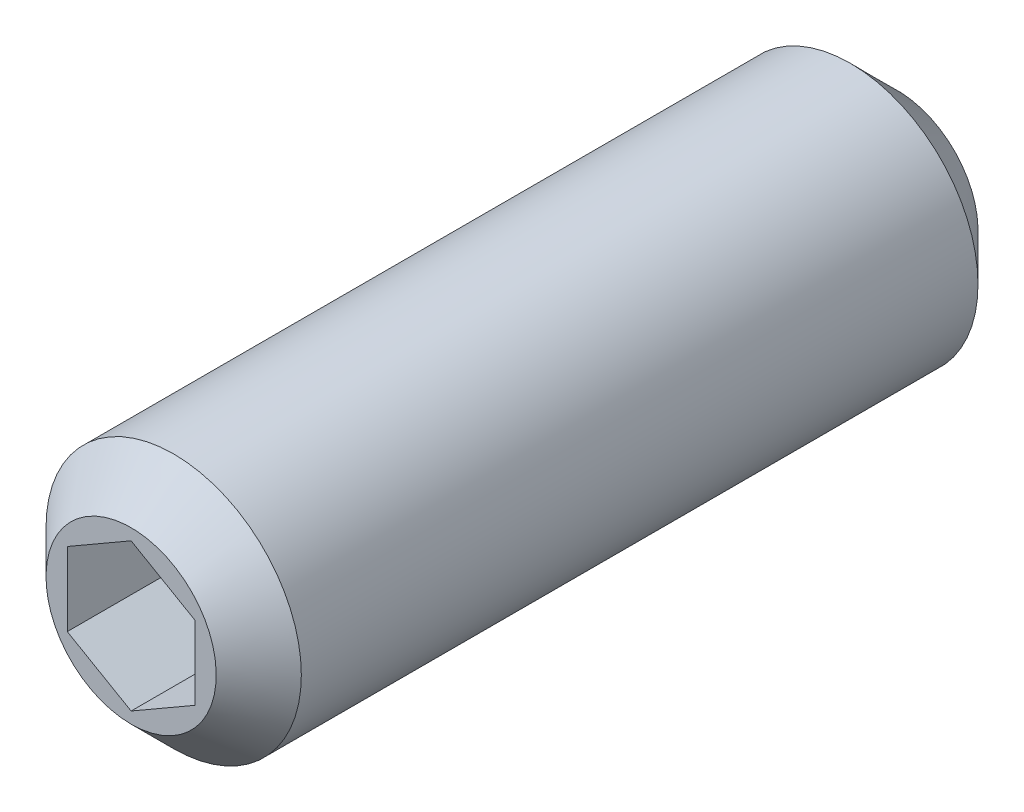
ISO-10303-21;
HEADER;
FILE_DESCRIPTION(('STEP AP214'),'2;1');
FILE_NAME('part.step','',(''),(''),'','','');
FILE_SCHEMA(('AUTOMOTIVE_DESIGN { 1 0 10303 214 1 1 1 1 }'));
ENDSEC;
DATA;
#1=APPLICATION_CONTEXT('core data for automotive mechanical design processes');
#2=APPLICATION_PROTOCOL_DEFINITION('international standard','automotive_design',2000,#1);
#3=PRODUCT_CONTEXT('',#1,'mechanical');
#4=PRODUCT('Part','Part','',(#3));
#5=PRODUCT_RELATED_PRODUCT_CATEGORY('part','',(#4));
#6=PRODUCT_DEFINITION_FORMATION('','',#4);
#7=PRODUCT_DEFINITION_CONTEXT('part definition',#1,'design');
#8=PRODUCT_DEFINITION('design','',#6,#7);
#9=PRODUCT_DEFINITION_SHAPE('','',#8);
#10=(LENGTH_UNIT() NAMED_UNIT(*) SI_UNIT(.MILLI.,.METRE.));
#11=(NAMED_UNIT(*) PLANE_ANGLE_UNIT() SI_UNIT($,.RADIAN.));
#12=(NAMED_UNIT(*) SI_UNIT($,.STERADIAN.) SOLID_ANGLE_UNIT());
#13=UNCERTAINTY_MEASURE_WITH_UNIT(LENGTH_MEASURE(1.E-05),#10,'distance_accuracy_value','');
#14=(GEOMETRIC_REPRESENTATION_CONTEXT(3) GLOBAL_UNCERTAINTY_ASSIGNED_CONTEXT((#13)) GLOBAL_UNIT_ASSIGNED_CONTEXT((#10,
#11,#12)) REPRESENTATION_CONTEXT('',''));
#15=CARTESIAN_POINT('',(0.,0.,0.));
#16=DIRECTION('',(0.,0.,1.));
#17=DIRECTION('',(1.,0.,0.));
#18=AXIS2_PLACEMENT_3D('',#15,#16,#17);
#19=CARTESIAN_POINT('',(0.,0.,9.5));
#20=DIRECTION('',(0.,0.,-1.));
#21=DIRECTION('',(0.,-1.,0.));
#22=AXIS2_PLACEMENT_3D('',#19,#20,#21);
#23=PLANE('',#22);
#24=DIRECTION('',(-0.866025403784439,-0.5,0.));
#25=VECTOR('',#24,1.);
#26=CARTESIAN_POINT('',(0.,0.866025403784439,9.5));
#27=LINE('',#26,#25);
#28=CARTESIAN_POINT('',(0.,0.866025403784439,9.5));
#29=VERTEX_POINT('',#28);
#30=CARTESIAN_POINT('',(-0.75,0.43301270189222,9.5));
#31=VERTEX_POINT('',#30);
#32=EDGE_CURVE('E173',#29,#31,#27,.T.);
#33=ORIENTED_EDGE('',*,*,#32,.F.);
#34=DIRECTION('',(-0.866025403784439,0.5,0.));
#35=VECTOR('',#34,1.);
#36=CARTESIAN_POINT('',(0.75,0.43301270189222,9.5));
#37=LINE('',#36,#35);
#38=CARTESIAN_POINT('',(0.75,0.43301270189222,9.5));
#39=VERTEX_POINT('',#38);
#40=EDGE_CURVE('E188',#39,#29,#37,.T.);
#41=ORIENTED_EDGE('',*,*,#40,.F.);
#42=DIRECTION('',(0.,1.,0.));
#43=VECTOR('',#42,1.);
#44=CARTESIAN_POINT('',(0.75,-0.433012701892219,9.5));
#45=LINE('',#44,#43);
#46=CARTESIAN_POINT('',(0.75,-0.433012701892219,9.5));
#47=VERTEX_POINT('',#46);
#48=EDGE_CURVE('E83',#47,#39,#45,.T.);
#49=ORIENTED_EDGE('',*,*,#48,.F.);
#50=DIRECTION('',(0.866025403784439,0.5,0.));
#51=VECTOR('',#50,1.);
#52=CARTESIAN_POINT('',(0.,-0.866025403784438,9.5));
#53=LINE('',#52,#51);
#54=CARTESIAN_POINT('',(0.,-0.866025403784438,9.5));
#55=VERTEX_POINT('',#54);
#56=EDGE_CURVE('E194',#55,#47,#53,.T.);
#57=ORIENTED_EDGE('',*,*,#56,.F.);
#58=DIRECTION('',(0.866025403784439,-0.5,0.));
#59=VECTOR('',#58,1.);
#60=CARTESIAN_POINT('',(-0.75,-0.433012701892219,9.5));
#61=LINE('',#60,#59);
#62=CARTESIAN_POINT('',(-0.75,-0.433012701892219,9.5));
#63=VERTEX_POINT('',#62);
#64=EDGE_CURVE('E192',#63,#55,#61,.T.);
#65=ORIENTED_EDGE('',*,*,#64,.F.);
#66=DIRECTION('',(0.,-1.,0.));
#67=VECTOR('',#66,1.);
#68=CARTESIAN_POINT('',(-0.75,0.43301270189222,9.5));
#69=LINE('',#68,#67);
#70=EDGE_CURVE('E178',#31,#63,#69,.T.);
#71=ORIENTED_EDGE('',*,*,#70,.F.);
#72=EDGE_LOOP('',(#33,#41,#49,#57,#65,#71));
#73=FACE_BOUND('',#72,.T.);
#74=CARTESIAN_POINT('',(0.,0.,9.5));
#75=DIRECTION('',(0.,0.,-1.));
#76=DIRECTION('',(0.,-1.,0.));
#77=AXIS2_PLACEMENT_3D('',#74,#75,#76);
#78=CIRCLE('',#77,1.);
#79=CARTESIAN_POINT('',(0.,-1.,9.5));
#80=VERTEX_POINT('',#79);
#81=EDGE_CURVE('E9',#80,#80,#78,.F.);
#82=ORIENTED_EDGE('',*,*,#81,.T.);
#83=EDGE_LOOP('',(#82));
#84=FACE_BOUND('',#83,.T.);
#85=ADVANCED_FACE('F14',(#73,#84),#23,.F.);
#86=CARTESIAN_POINT('',(0.,0.,0.5));
#87=DIRECTION('',(0.,0.,1.));
#88=DIRECTION('',(0.,1.,0.));
#89=AXIS2_PLACEMENT_3D('',#86,#87,#88);
#90=CYLINDRICAL_SURFACE('',#89,1.5);
#91=CARTESIAN_POINT('',(0.,0.,9.));
#92=DIRECTION('',(0.,0.,-1.));
#93=DIRECTION('',(0.,-1.,0.));
#94=AXIS2_PLACEMENT_3D('',#91,#92,#93);
#95=CIRCLE('',#94,1.5);
#96=CARTESIAN_POINT('',(0.,-1.5,9.));
#97=VERTEX_POINT('',#96);
#98=EDGE_CURVE('E22',#97,#97,#95,.T.);
#99=ORIENTED_EDGE('',*,*,#98,.T.);
#100=EDGE_LOOP('',(#99));
#101=FACE_BOUND('',#100,.T.);
#102=CARTESIAN_POINT('',(0.,0.,1.05));
#103=DIRECTION('',(0.,0.,-1.));
#104=DIRECTION('',(-1.,0.,0.));
#105=AXIS2_PLACEMENT_3D('',#102,#103,#104);
#106=CIRCLE('',#105,1.5);
#107=CARTESIAN_POINT('',(-1.5,0.,1.05));
#108=VERTEX_POINT('',#107);
#109=EDGE_CURVE('E73',#108,#108,#106,.T.);
#110=ORIENTED_EDGE('',*,*,#109,.F.);
#111=EDGE_LOOP('',(#110));
#112=FACE_BOUND('',#111,.T.);
#113=ADVANCED_FACE('F16',(#101,#112),#90,.T.);
#114=CARTESIAN_POINT('',(0.,0.,9.));
#115=DIRECTION('',(0.,0.,-1.));
#116=DIRECTION('',(0.,-1.,0.));
#117=AXIS2_PLACEMENT_3D('',#114,#115,#116);
#118=CONICAL_SURFACE('',#117,1.5,0.78539816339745);
#119=ORIENTED_EDGE('',*,*,#81,.F.);
#120=EDGE_LOOP('',(#119));
#121=FACE_BOUND('',#120,.T.);
#122=ORIENTED_EDGE('',*,*,#98,.F.);
#123=EDGE_LOOP('',(#122));
#124=FACE_BOUND('',#123,.T.);
#125=ADVANCED_FACE('F108',(#121,#124),#118,.T.);
#126=CARTESIAN_POINT('',(0.75,0.43301270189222,7.5));
#127=DIRECTION('',(0.5,0.866025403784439,0.));
#128=DIRECTION('',(0.866025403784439,-0.5,0.));
#129=AXIS2_PLACEMENT_3D('',#126,#127,#128);
#130=PLANE('',#129);
#131=DIRECTION('',(0.,0.,1.));
#132=VECTOR('',#131,1.);
#133=CARTESIAN_POINT('',(0.,0.866025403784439,7.5));
#134=LINE('',#133,#132);
#135=CARTESIAN_POINT('',(0.,0.866025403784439,8.));
#136=VERTEX_POINT('',#135);
#137=EDGE_CURVE('E36',#136,#29,#134,.T.);
#138=ORIENTED_EDGE('',*,*,#137,.F.);
#139=DIRECTION('',(-0.866025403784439,0.5,0.));
#140=VECTOR('',#139,1.);
#141=CARTESIAN_POINT('',(0.75,0.43301270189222,8.));
#142=LINE('',#141,#140);
#143=CARTESIAN_POINT('',(0.75,0.43301270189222,8.));
#144=VERTEX_POINT('',#143);
#145=EDGE_CURVE('E29',#144,#136,#142,.T.);
#146=ORIENTED_EDGE('',*,*,#145,.F.);
#147=DIRECTION('',(0.,0.,1.));
#148=VECTOR('',#147,1.);
#149=CARTESIAN_POINT('',(0.75,0.43301270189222,7.5));
#150=LINE('',#149,#148);
#151=EDGE_CURVE('E77',#144,#39,#150,.T.);
#152=ORIENTED_EDGE('',*,*,#151,.T.);
#153=ORIENTED_EDGE('',*,*,#40,.T.);
#154=EDGE_LOOP('',(#138,#146,#152,#153));
#155=FACE_BOUND('',#154,.T.);
#156=ADVANCED_FACE('F76',(#155),#130,.F.);
#157=CARTESIAN_POINT('',(0.75,-0.433012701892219,7.5));
#158=DIRECTION('',(1.,0.,0.));
#159=DIRECTION('',(0.,-1.,0.));
#160=AXIS2_PLACEMENT_3D('',#157,#158,#159);
#161=PLANE('',#160);
#162=ORIENTED_EDGE('',*,*,#151,.F.);
#163=DIRECTION('',(0.,1.,0.));
#164=VECTOR('',#163,1.);
#165=CARTESIAN_POINT('',(0.75,-0.433012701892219,8.));
#166=LINE('',#165,#164);
#167=CARTESIAN_POINT('',(0.75,-0.433012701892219,8.));
#168=VERTEX_POINT('',#167);
#169=EDGE_CURVE('E66',#168,#144,#166,.T.);
#170=ORIENTED_EDGE('',*,*,#169,.F.);
#171=DIRECTION('',(0.,0.,1.));
#172=VECTOR('',#171,1.);
#173=CARTESIAN_POINT('',(0.75,-0.433012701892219,7.5));
#174=LINE('',#173,#172);
#175=EDGE_CURVE('E86',#168,#47,#174,.T.);
#176=ORIENTED_EDGE('',*,*,#175,.T.);
#177=ORIENTED_EDGE('',*,*,#48,.T.);
#178=EDGE_LOOP('',(#162,#170,#176,#177));
#179=FACE_BOUND('',#178,.T.);
#180=ADVANCED_FACE('F81',(#179),#161,.F.);
#181=CARTESIAN_POINT('',(0.,-0.866025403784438,7.5));
#182=DIRECTION('',(0.5,-0.866025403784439,0.));
#183=DIRECTION('',(-0.866025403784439,-0.5,0.));
#184=AXIS2_PLACEMENT_3D('',#181,#182,#183);
#185=PLANE('',#184);
#186=ORIENTED_EDGE('',*,*,#175,.F.);
#187=DIRECTION('',(0.866025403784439,0.5,0.));
#188=VECTOR('',#187,1.);
#189=CARTESIAN_POINT('',(0.,-0.866025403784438,8.));
#190=LINE('',#189,#188);
#191=CARTESIAN_POINT('',(0.,-0.866025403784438,8.));
#192=VERTEX_POINT('',#191);
#193=EDGE_CURVE('E69',#192,#168,#190,.T.);
#194=ORIENTED_EDGE('',*,*,#193,.F.);
#195=DIRECTION('',(0.,0.,1.));
#196=VECTOR('',#195,1.);
#197=CARTESIAN_POINT('',(0.,-0.866025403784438,7.5));
#198=LINE('',#197,#196);
#199=EDGE_CURVE('E91',#192,#55,#198,.T.);
#200=ORIENTED_EDGE('',*,*,#199,.T.);
#201=ORIENTED_EDGE('',*,*,#56,.T.);
#202=EDGE_LOOP('',(#186,#194,#200,#201));
#203=FACE_BOUND('',#202,.T.);
#204=ADVANCED_FACE('F156',(#203),#185,.F.);
#205=CARTESIAN_POINT('',(-0.75,-0.433012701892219,7.5));
#206=DIRECTION('',(-0.5,-0.866025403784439,0.));
#207=DIRECTION('',(-0.866025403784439,0.5,0.));
#208=AXIS2_PLACEMENT_3D('',#205,#206,#207);
#209=PLANE('',#208);
#210=ORIENTED_EDGE('',*,*,#199,.F.);
#211=DIRECTION('',(0.866025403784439,-0.5,0.));
#212=VECTOR('',#211,1.);
#213=CARTESIAN_POINT('',(-0.75,-0.433012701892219,8.));
#214=LINE('',#213,#212);
#215=CARTESIAN_POINT('',(-0.75,-0.433012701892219,8.));
#216=VERTEX_POINT('',#215);
#217=EDGE_CURVE('E182',#216,#192,#214,.T.);
#218=ORIENTED_EDGE('',*,*,#217,.F.);
#219=DIRECTION('',(0.,0.,1.));
#220=VECTOR('',#219,1.);
#221=CARTESIAN_POINT('',(-0.75,-0.433012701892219,7.5));
#222=LINE('',#221,#220);
#223=EDGE_CURVE('E97',#216,#63,#222,.T.);
#224=ORIENTED_EDGE('',*,*,#223,.T.);
#225=ORIENTED_EDGE('',*,*,#64,.T.);
#226=EDGE_LOOP('',(#210,#218,#224,#225));
#227=FACE_BOUND('',#226,.T.);
#228=ADVANCED_FACE('F159',(#227),#209,.F.);
#229=CARTESIAN_POINT('',(-0.75,0.43301270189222,7.5));
#230=DIRECTION('',(-1.,0.,0.));
#231=DIRECTION('',(0.,1.,0.));
#232=AXIS2_PLACEMENT_3D('',#229,#230,#231);
#233=PLANE('',#232);
#234=ORIENTED_EDGE('',*,*,#223,.F.);
#235=DIRECTION('',(0.,-1.,0.));
#236=VECTOR('',#235,1.);
#237=CARTESIAN_POINT('',(-0.75,0.43301270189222,8.));
#238=LINE('',#237,#236);
#239=CARTESIAN_POINT('',(-0.75,0.43301270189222,8.));
#240=VERTEX_POINT('',#239);
#241=EDGE_CURVE('E180',#240,#216,#238,.T.);
#242=ORIENTED_EDGE('',*,*,#241,.F.);
#243=DIRECTION('',(0.,0.,1.));
#244=VECTOR('',#243,1.);
#245=CARTESIAN_POINT('',(-0.75,0.43301270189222,7.5));
#246=LINE('',#245,#244);
#247=EDGE_CURVE('E99',#240,#31,#246,.T.);
#248=ORIENTED_EDGE('',*,*,#247,.T.);
#249=ORIENTED_EDGE('',*,*,#70,.T.);
#250=EDGE_LOOP('',(#234,#242,#248,#249));
#251=FACE_BOUND('',#250,.T.);
#252=ADVANCED_FACE('F163',(#251),#233,.F.);
#253=CARTESIAN_POINT('',(0.,0.866025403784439,7.5));
#254=DIRECTION('',(-0.5,0.866025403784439,0.));
#255=DIRECTION('',(0.866025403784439,0.5,0.));
#256=AXIS2_PLACEMENT_3D('',#253,#254,#255);
#257=PLANE('',#256);
#258=ORIENTED_EDGE('',*,*,#247,.F.);
#259=DIRECTION('',(-0.866025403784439,-0.5,0.));
#260=VECTOR('',#259,1.);
#261=CARTESIAN_POINT('',(0.,0.866025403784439,8.));
#262=LINE('',#261,#260);
#263=EDGE_CURVE('E79',#136,#240,#262,.T.);
#264=ORIENTED_EDGE('',*,*,#263,.F.);
#265=ORIENTED_EDGE('',*,*,#137,.T.);
#266=ORIENTED_EDGE('',*,*,#32,.T.);
#267=EDGE_LOOP('',(#258,#264,#265,#266));
#268=FACE_BOUND('',#267,.T.);
#269=ADVANCED_FACE('F150',(#268),#257,.F.);
#270=CARTESIAN_POINT('',(0.75,0.43301270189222,8.));
#271=DIRECTION('',(0.,0.,1.));
#272=DIRECTION('',(1.,0.,0.));
#273=AXIS2_PLACEMENT_3D('',#270,#271,#272);
#274=PLANE('',#273);
#275=ORIENTED_EDGE('',*,*,#169,.T.);
#276=ORIENTED_EDGE('',*,*,#145,.T.);
#277=ORIENTED_EDGE('',*,*,#263,.T.);
#278=ORIENTED_EDGE('',*,*,#241,.T.);
#279=ORIENTED_EDGE('',*,*,#217,.T.);
#280=ORIENTED_EDGE('',*,*,#193,.T.);
#281=EDGE_LOOP('',(#275,#276,#277,#278,#279,#280));
#282=FACE_BOUND('',#281,.T.);
#283=ADVANCED_FACE('F67',(#282),#274,.T.);
#284=CARTESIAN_POINT('',(0.,0.,0.5));
#285=DIRECTION('',(0.,0.,1.));
#286=DIRECTION('',(1.,0.,0.));
#287=AXIS2_PLACEMENT_3D('',#284,#285,#286);
#288=CONICAL_SURFACE('',#287,0.95,0.785398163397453);
#289=ORIENTED_EDGE('',*,*,#109,.T.);
#290=EDGE_LOOP('',(#289));
#291=FACE_BOUND('',#290,.T.);
#292=CARTESIAN_POINT('',(0.,0.,0.5));
#293=DIRECTION('',(0.,0.,-1.));
#294=DIRECTION('',(0.,-1.,0.));
#295=AXIS2_PLACEMENT_3D('',#292,#293,#294);
#296=CIRCLE('',#295,0.95);
#297=CARTESIAN_POINT('',(0.,-0.95,0.5));
#298=VERTEX_POINT('',#297);
#299=EDGE_CURVE('E85',#298,#298,#296,.F.);
#300=ORIENTED_EDGE('',*,*,#299,.T.);
#301=EDGE_LOOP('',(#300));
#302=FACE_BOUND('',#301,.T.);
#303=ADVANCED_FACE('F137',(#291,#302),#288,.T.);
#304=CARTESIAN_POINT('',(0.,0.,0.75));
#305=DIRECTION('',(0.,0.,-1.));
#306=DIRECTION('',(-1.,0.,0.));
#307=AXIS2_PLACEMENT_3D('',#304,#305,#306);
#308=SPHERICAL_SURFACE('',#307,0.75);
#309=CARTESIAN_POINT('',(0.,0.,0.5));
#310=DIRECTION('',(0.,0.,-1.));
#311=DIRECTION('',(0.,-1.,0.));
#312=AXIS2_PLACEMENT_3D('',#309,#310,#311);
#313=CIRCLE('',#312,0.707106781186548);
#314=CARTESIAN_POINT('',(0.,-0.707106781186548,0.5));
#315=VERTEX_POINT('',#314);
#316=EDGE_CURVE('E89',#315,#315,#313,.F.);
#317=ORIENTED_EDGE('',*,*,#316,.F.);
#318=EDGE_LOOP('',(#317));
#319=FACE_BOUND('',#318,.T.);
#320=ADVANCED_FACE('F129',(#319),#308,.T.);
#321=CARTESIAN_POINT('',(0.,0.,0.5));
#322=DIRECTION('',(0.,0.,-1.));
#323=DIRECTION('',(0.,-1.,0.));
#324=AXIS2_PLACEMENT_3D('',#321,#322,#323);
#325=PLANE('',#324);
#326=ORIENTED_EDGE('',*,*,#299,.F.);
#327=EDGE_LOOP('',(#326));
#328=FACE_BOUND('',#327,.T.);
#329=ORIENTED_EDGE('',*,*,#316,.T.);
#330=EDGE_LOOP('',(#329));
#331=FACE_BOUND('',#330,.T.);
#332=ADVANCED_FACE('F130',(#328,#331),#325,.T.);
#333=CLOSED_SHELL('',(#85,#113,#125,#156,#180,#204,#228,#252,#269,#283,#303,#320,#332));
#334=MANIFOLD_SOLID_BREP('B1',#333);
#335=ADVANCED_BREP_SHAPE_REPRESENTATION('',(#18,#334),#14);
#336=SHAPE_DEFINITION_REPRESENTATION(#9,#335);
ENDSEC;
END-ISO-10303-21;
